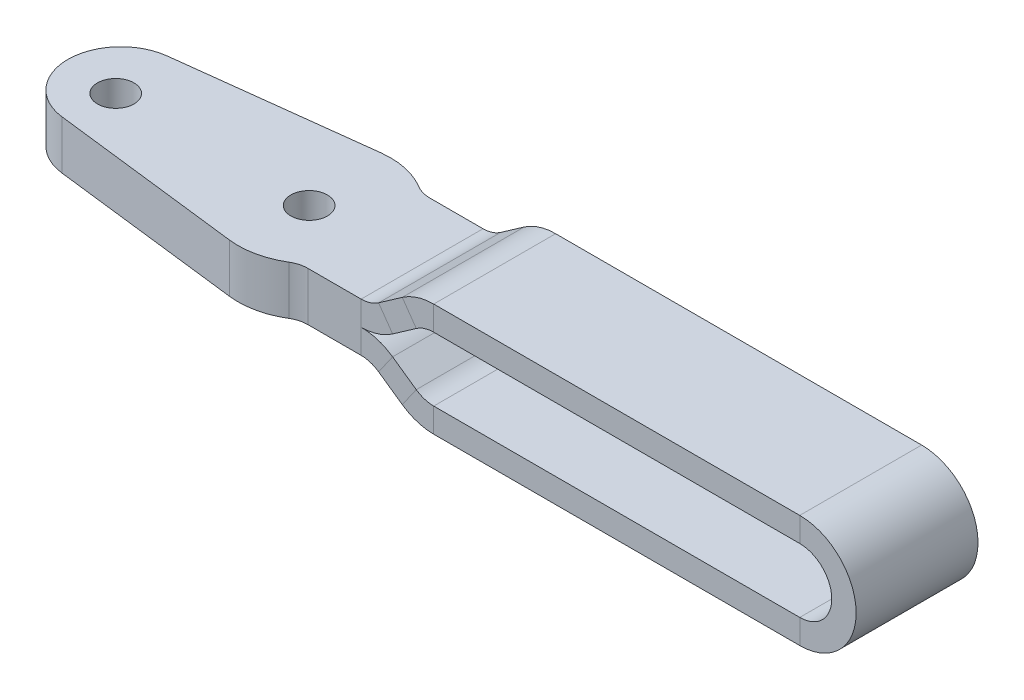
ISO-10303-21;
HEADER;
FILE_DESCRIPTION(('STEP AP214'),'2;1');
FILE_NAME('part.step','',(''),(''),'','','');
FILE_SCHEMA(('AUTOMOTIVE_DESIGN { 1 0 10303 214 1 1 1 1 }'));
ENDSEC;
DATA;
#1=APPLICATION_CONTEXT('core data for automotive mechanical design processes');
#2=APPLICATION_PROTOCOL_DEFINITION('international standard','automotive_design',2000,#1);
#3=PRODUCT_CONTEXT('',#1,'mechanical');
#4=PRODUCT('Part','Part','',(#3));
#5=PRODUCT_RELATED_PRODUCT_CATEGORY('part','',(#4));
#6=PRODUCT_DEFINITION_FORMATION('','',#4);
#7=PRODUCT_DEFINITION_CONTEXT('part definition',#1,'design');
#8=PRODUCT_DEFINITION('design','',#6,#7);
#9=PRODUCT_DEFINITION_SHAPE('','',#8);
#10=(LENGTH_UNIT() NAMED_UNIT(*) SI_UNIT(.MILLI.,.METRE.));
#11=(NAMED_UNIT(*) PLANE_ANGLE_UNIT() SI_UNIT($,.RADIAN.));
#12=(NAMED_UNIT(*) SI_UNIT($,.STERADIAN.) SOLID_ANGLE_UNIT());
#13=UNCERTAINTY_MEASURE_WITH_UNIT(LENGTH_MEASURE(1.E-05),#10,'distance_accuracy_value','');
#14=(GEOMETRIC_REPRESENTATION_CONTEXT(3) GLOBAL_UNCERTAINTY_ASSIGNED_CONTEXT((#13)) GLOBAL_UNIT_ASSIGNED_CONTEXT((#10,
#11,#12)) REPRESENTATION_CONTEXT('',''));
#15=CARTESIAN_POINT('',(0.,0.,0.));
#16=DIRECTION('',(0.,0.,1.));
#17=DIRECTION('',(1.,0.,0.));
#18=AXIS2_PLACEMENT_3D('',#15,#16,#17);
#19=CARTESIAN_POINT('',(121.348589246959,0.,-10.91));
#20=DIRECTION('',(0.,0.,1.));
#21=DIRECTION('',(0.,-1.,0.));
#22=AXIS2_PLACEMENT_3D('',#19,#20,#21);
#23=PLANE('',#22);
#24=CARTESIAN_POINT('',(121.348589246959,0.,-10.91));
#25=DIRECTION('',(0.,0.,1.));
#26=DIRECTION('',(0.,-1.,0.));
#27=AXIS2_PLACEMENT_3D('',#24,#25,#26);
#28=CIRCLE('',#27,9.25);
#29=CARTESIAN_POINT('',(121.348589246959,9.25,-10.91));
#30=VERTEX_POINT('',#29);
#31=CARTESIAN_POINT('',(121.348589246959,-9.25,-10.91));
#32=VERTEX_POINT('',#31);
#33=EDGE_CURVE('E424',#30,#32,#28,.F.);
#34=ORIENTED_EDGE('',*,*,#33,.T.);
#35=DIRECTION('',(0.,-1.,0.));
#36=VECTOR('',#35,1.);
#37=CARTESIAN_POINT('',(121.348589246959,-5.25,-10.91));
#38=LINE('',#37,#36);
#39=CARTESIAN_POINT('',(121.348589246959,-5.25,-10.91));
#40=VERTEX_POINT('',#39);
#41=EDGE_CURVE('E281',#40,#32,#38,.T.);
#42=ORIENTED_EDGE('',*,*,#41,.F.);
#43=CARTESIAN_POINT('',(121.348589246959,0.,-10.91));
#44=DIRECTION('',(0.,0.,-1.));
#45=DIRECTION('',(0.,1.,0.));
#46=AXIS2_PLACEMENT_3D('',#43,#44,#45);
#47=CIRCLE('',#46,5.25);
#48=CARTESIAN_POINT('',(121.348589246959,5.25,-10.91));
#49=VERTEX_POINT('',#48);
#50=EDGE_CURVE('E411',#49,#40,#47,.T.);
#51=ORIENTED_EDGE('',*,*,#50,.F.);
#52=DIRECTION('',(0.,1.,0.));
#53=VECTOR('',#52,1.);
#54=CARTESIAN_POINT('',(121.348589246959,5.25,-10.91));
#55=LINE('',#54,#53);
#56=EDGE_CURVE('E426',#49,#30,#55,.T.);
#57=ORIENTED_EDGE('',*,*,#56,.T.);
#58=EDGE_LOOP('',(#34,#42,#51,#57));
#59=FACE_BOUND('',#58,.T.);
#60=ADVANCED_FACE('F14',(#59),#23,.F.);
#61=CARTESIAN_POINT('',(121.348589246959,0.,-31.4840262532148));
#62=DIRECTION('',(0.,0.,1.));
#63=DIRECTION('',(0.,-1.,0.));
#64=AXIS2_PLACEMENT_3D('',#61,#62,#63);
#65=CYLINDRICAL_SURFACE('',#64,9.25);
#66=CARTESIAN_POINT('',(121.348589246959,0.,9.09));
#67=DIRECTION('',(0.,0.,1.));
#68=DIRECTION('',(0.,-1.,0.));
#69=AXIS2_PLACEMENT_3D('',#66,#67,#68);
#70=CIRCLE('',#69,9.25);
#71=CARTESIAN_POINT('',(121.348589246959,-9.25,9.09));
#72=VERTEX_POINT('',#71);
#73=CARTESIAN_POINT('',(121.348589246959,9.25,9.09));
#74=VERTEX_POINT('',#73);
#75=EDGE_CURVE('E419',#72,#74,#70,.T.);
#76=ORIENTED_EDGE('',*,*,#75,.F.);
#77=DIRECTION('',(0.,0.,1.));
#78=VECTOR('',#77,1.);
#79=CARTESIAN_POINT('',(121.348589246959,-9.25,-0.910000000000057));
#80=LINE('',#79,#78);
#81=EDGE_CURVE('E278',#32,#72,#80,.T.);
#82=ORIENTED_EDGE('',*,*,#81,.F.);
#83=ORIENTED_EDGE('',*,*,#33,.F.);
#84=DIRECTION('',(0.,0.,1.));
#85=VECTOR('',#84,1.);
#86=CARTESIAN_POINT('',(121.348589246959,9.25,-0.91000000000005));
#87=LINE('',#86,#85);
#88=EDGE_CURVE('E421',#30,#74,#87,.T.);
#89=ORIENTED_EDGE('',*,*,#88,.T.);
#90=EDGE_LOOP('',(#76,#82,#83,#89));
#91=FACE_BOUND('',#90,.T.);
#92=ADVANCED_FACE('F580',(#91),#65,.T.);
#93=CARTESIAN_POINT('',(121.348589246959,0.,9.09));
#94=DIRECTION('',(0.,0.,-1.));
#95=DIRECTION('',(0.,1.,0.));
#96=AXIS2_PLACEMENT_3D('',#93,#94,#95);
#97=PLANE('',#96);
#98=CARTESIAN_POINT('',(121.348589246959,0.,9.09));
#99=DIRECTION('',(0.,0.,1.));
#100=DIRECTION('',(0.,-1.,0.));
#101=AXIS2_PLACEMENT_3D('',#98,#99,#100);
#102=CIRCLE('',#101,5.25);
#103=CARTESIAN_POINT('',(121.348589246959,-5.25,9.09));
#104=VERTEX_POINT('',#103);
#105=CARTESIAN_POINT('',(121.348589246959,5.25,9.09));
#106=VERTEX_POINT('',#105);
#107=EDGE_CURVE('E414',#104,#106,#102,.T.);
#108=ORIENTED_EDGE('',*,*,#107,.F.);
#109=DIRECTION('',(0.,1.,0.));
#110=VECTOR('',#109,1.);
#111=CARTESIAN_POINT('',(121.348589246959,-5.25,9.09));
#112=LINE('',#111,#110);
#113=EDGE_CURVE('E274',#72,#104,#112,.T.);
#114=ORIENTED_EDGE('',*,*,#113,.F.);
#115=ORIENTED_EDGE('',*,*,#75,.T.);
#116=DIRECTION('',(0.,-1.,0.));
#117=VECTOR('',#116,1.);
#118=CARTESIAN_POINT('',(121.348589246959,5.25,9.09));
#119=LINE('',#118,#117);
#120=EDGE_CURVE('E416',#74,#106,#119,.T.);
#121=ORIENTED_EDGE('',*,*,#120,.T.);
#122=EDGE_LOOP('',(#108,#114,#115,#121));
#123=FACE_BOUND('',#122,.T.);
#124=ADVANCED_FACE('F601',(#123),#97,.F.);
#125=CARTESIAN_POINT('',(121.348589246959,0.,-31.4840262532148));
#126=DIRECTION('',(0.,0.,1.));
#127=DIRECTION('',(0.,-1.,0.));
#128=AXIS2_PLACEMENT_3D('',#125,#126,#127);
#129=CYLINDRICAL_SURFACE('',#128,5.25);
#130=ORIENTED_EDGE('',*,*,#50,.T.);
#131=DIRECTION('',(0.,0.,1.));
#132=VECTOR('',#131,1.);
#133=CARTESIAN_POINT('',(121.348589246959,-5.25,-0.91000000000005));
#134=LINE('',#133,#132);
#135=EDGE_CURVE('E285',#40,#104,#134,.T.);
#136=ORIENTED_EDGE('',*,*,#135,.T.);
#137=ORIENTED_EDGE('',*,*,#107,.T.);
#138=DIRECTION('',(0.,0.,1.));
#139=VECTOR('',#138,1.);
#140=CARTESIAN_POINT('',(121.348589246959,5.25,-0.91000000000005));
#141=LINE('',#140,#139);
#142=EDGE_CURVE('E430',#49,#106,#141,.T.);
#143=ORIENTED_EDGE('',*,*,#142,.F.);
#144=EDGE_LOOP('',(#130,#136,#137,#143));
#145=FACE_BOUND('',#144,.T.);
#146=ADVANCED_FACE('F594',(#145),#129,.F.);
#147=CARTESIAN_POINT('',(-1.44720887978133,5.24999999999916,-0.91));
#148=DIRECTION('',(0.,-1.,0.));
#149=DIRECTION('',(1.,0.,0.));
#150=AXIS2_PLACEMENT_3D('',#147,#148,#149);
#151=PLANE('',#150);
#152=DIRECTION('',(-1.,0.,0.));
#153=VECTOR('',#152,1.);
#154=CARTESIAN_POINT('',(39.2330253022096,5.24999999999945,9.09));
#155=LINE('',#154,#153);
#156=CARTESIAN_POINT('',(61.280819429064,5.2499999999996,9.09));
#157=VERTEX_POINT('',#156);
#158=EDGE_CURVE('E429',#106,#157,#155,.T.);
#159=ORIENTED_EDGE('',*,*,#158,.T.);
#160=DIRECTION('',(0.,0.,-1.));
#161=VECTOR('',#160,1.);
#162=CARTESIAN_POINT('',(61.280819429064,5.2499999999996,-0.91));
#163=LINE('',#162,#161);
#164=CARTESIAN_POINT('',(61.280819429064,5.2499999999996,-10.91));
#165=VERTEX_POINT('',#164);
#166=EDGE_CURVE('E413',#157,#165,#163,.T.);
#167=ORIENTED_EDGE('',*,*,#166,.T.);
#168=DIRECTION('',(1.,0.,0.));
#169=VECTOR('',#168,1.);
#170=CARTESIAN_POINT('',(226.240699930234,5.25000000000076,-10.91));
#171=LINE('',#170,#169);
#172=EDGE_CURVE('E433',#165,#49,#171,.T.);
#173=ORIENTED_EDGE('',*,*,#172,.T.);
#174=ORIENTED_EDGE('',*,*,#142,.T.);
#175=EDGE_LOOP('',(#159,#167,#173,#174));
#176=FACE_BOUND('',#175,.T.);
#177=ADVANCED_FACE('F597',(#176),#151,.T.);
#178=CARTESIAN_POINT('',(226.240699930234,5.25000000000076,-10.91));
#179=DIRECTION('',(0.,0.,1.));
#180=DIRECTION('',(-1.,0.,0.));
#181=AXIS2_PLACEMENT_3D('',#178,#179,#180);
#182=PLANE('',#181);
#183=DIRECTION('',(0.,-1.,0.));
#184=VECTOR('',#183,1.);
#185=CARTESIAN_POINT('',(61.280819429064,5.2499999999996,-10.91));
#186=LINE('',#185,#184);
#187=CARTESIAN_POINT('',(61.280819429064,9.2499999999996,-10.91));
#188=VERTEX_POINT('',#187);
#189=EDGE_CURVE('E442',#188,#165,#186,.T.);
#190=ORIENTED_EDGE('',*,*,#189,.F.);
#191=DIRECTION('',(1.,0.,0.));
#192=VECTOR('',#191,1.);
#193=CARTESIAN_POINT('',(226.240699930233,9.25000000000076,-10.91));
#194=LINE('',#193,#192);
#195=EDGE_CURVE('E406',#188,#30,#194,.T.);
#196=ORIENTED_EDGE('',*,*,#195,.T.);
#197=ORIENTED_EDGE('',*,*,#56,.F.);
#198=ORIENTED_EDGE('',*,*,#172,.F.);
#199=EDGE_LOOP('',(#190,#196,#197,#198));
#200=FACE_BOUND('',#199,.T.);
#201=ADVANCED_FACE('F591',(#200),#182,.F.);
#202=CARTESIAN_POINT('',(-1.44720887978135,9.24999999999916,-0.91));
#203=DIRECTION('',(0.,-1.,0.));
#204=DIRECTION('',(1.,0.,0.));
#205=AXIS2_PLACEMENT_3D('',#202,#203,#204);
#206=PLANE('',#205);
#207=DIRECTION('',(0.,0.,-1.));
#208=VECTOR('',#207,1.);
#209=CARTESIAN_POINT('',(61.280819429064,9.2499999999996,-0.91));
#210=LINE('',#209,#208);
#211=CARTESIAN_POINT('',(61.280819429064,9.2499999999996,9.09));
#212=VERTEX_POINT('',#211);
#213=EDGE_CURVE('E439',#212,#188,#210,.T.);
#214=ORIENTED_EDGE('',*,*,#213,.F.);
#215=DIRECTION('',(-1.,0.,0.));
#216=VECTOR('',#215,1.);
#217=CARTESIAN_POINT('',(39.2330253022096,9.24999999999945,9.09));
#218=LINE('',#217,#216);
#219=EDGE_CURVE('E447',#74,#212,#218,.T.);
#220=ORIENTED_EDGE('',*,*,#219,.F.);
#221=ORIENTED_EDGE('',*,*,#88,.F.);
#222=ORIENTED_EDGE('',*,*,#195,.F.);
#223=EDGE_LOOP('',(#214,#220,#221,#222));
#224=FACE_BOUND('',#223,.T.);
#225=ADVANCED_FACE('F607',(#224),#206,.F.);
#226=CARTESIAN_POINT('',(39.2330253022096,5.24999999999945,9.09));
#227=DIRECTION('',(0.,0.,-1.));
#228=DIRECTION('',(1.,0.,0.));
#229=AXIS2_PLACEMENT_3D('',#226,#227,#228);
#230=PLANE('',#229);
#231=DIRECTION('',(0.,1.,0.));
#232=VECTOR('',#231,1.);
#233=CARTESIAN_POINT('',(61.280819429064,5.2499999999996,9.09));
#234=LINE('',#233,#232);
#235=EDGE_CURVE('E436',#157,#212,#234,.T.);
#236=ORIENTED_EDGE('',*,*,#235,.F.);
#237=ORIENTED_EDGE('',*,*,#158,.F.);
#238=ORIENTED_EDGE('',*,*,#120,.F.);
#239=ORIENTED_EDGE('',*,*,#219,.T.);
#240=EDGE_LOOP('',(#236,#237,#238,#239));
#241=FACE_BOUND('',#240,.T.);
#242=ADVANCED_FACE('F604',(#241),#230,.F.);
#243=CARTESIAN_POINT('',(61.2808194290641,0.249999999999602,9.09));
#244=DIRECTION('',(0.,0.,-1.));
#245=DIRECTION('',(0.,1.,0.));
#246=AXIS2_PLACEMENT_3D('',#243,#244,#245);
#247=PLANE('',#246);
#248=ORIENTED_EDGE('',*,*,#235,.T.);
#249=CARTESIAN_POINT('',(61.2808194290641,0.249999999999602,9.09));
#250=DIRECTION('',(0.,0.,-1.));
#251=DIRECTION('',(0.,1.,0.));
#252=AXIS2_PLACEMENT_3D('',#249,#250,#251);
#253=CIRCLE('',#252,9.);
#254=CARTESIAN_POINT('',(56.1186315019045,7.62236839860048,9.09));
#255=VERTEX_POINT('',#254);
#256=EDGE_CURVE('E391',#212,#255,#253,.F.);
#257=ORIENTED_EDGE('',*,*,#256,.T.);
#258=DIRECTION('',(-0.573576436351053,0.819152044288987,0.));
#259=VECTOR('',#258,1.);
#260=CARTESIAN_POINT('',(58.4129372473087,4.34576022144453,9.09));
#261=LINE('',#260,#259);
#262=CARTESIAN_POINT('',(58.4129372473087,4.34576022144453,9.09));
#263=VERTEX_POINT('',#262);
#264=EDGE_CURVE('E394',#263,#255,#261,.T.);
#265=ORIENTED_EDGE('',*,*,#264,.F.);
#266=CARTESIAN_POINT('',(61.2808194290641,0.249999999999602,9.09));
#267=DIRECTION('',(0.,0.,1.));
#268=DIRECTION('',(0.,-1.,0.));
#269=AXIS2_PLACEMENT_3D('',#266,#267,#268);
#270=CIRCLE('',#269,5.);
#271=EDGE_CURVE('E399',#157,#263,#270,.T.);
#272=ORIENTED_EDGE('',*,*,#271,.F.);
#273=EDGE_LOOP('',(#248,#257,#265,#272));
#274=FACE_BOUND('',#273,.T.);
#275=ADVANCED_FACE('F613',(#274),#247,.F.);
#276=CARTESIAN_POINT('',(61.2808194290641,0.249999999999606,-10.91));
#277=DIRECTION('',(0.,0.,1.));
#278=DIRECTION('',(0.,-1.,0.));
#279=AXIS2_PLACEMENT_3D('',#276,#277,#278);
#280=PLANE('',#279);
#281=CARTESIAN_POINT('',(61.2808194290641,0.249999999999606,-10.91));
#282=DIRECTION('',(0.,0.,-1.));
#283=DIRECTION('',(0.,1.,0.));
#284=AXIS2_PLACEMENT_3D('',#281,#282,#283);
#285=CIRCLE('',#284,9.);
#286=CARTESIAN_POINT('',(56.1186315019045,7.62236839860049,-10.91));
#287=VERTEX_POINT('',#286);
#288=EDGE_CURVE('E403',#287,#188,#285,.T.);
#289=ORIENTED_EDGE('',*,*,#288,.T.);
#290=ORIENTED_EDGE('',*,*,#189,.T.);
#291=CARTESIAN_POINT('',(61.2808194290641,0.249999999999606,-10.91));
#292=DIRECTION('',(0.,0.,-1.));
#293=DIRECTION('',(0.,1.,0.));
#294=AXIS2_PLACEMENT_3D('',#291,#292,#293);
#295=CIRCLE('',#294,5.);
#296=CARTESIAN_POINT('',(58.4129372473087,4.34576022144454,-10.91));
#297=VERTEX_POINT('',#296);
#298=EDGE_CURVE('E402',#297,#165,#295,.T.);
#299=ORIENTED_EDGE('',*,*,#298,.F.);
#300=DIRECTION('',(0.573576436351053,-0.819152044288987,0.));
#301=VECTOR('',#300,1.);
#302=CARTESIAN_POINT('',(58.4129372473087,4.34576022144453,-10.91));
#303=LINE('',#302,#301);
#304=EDGE_CURVE('E389',#287,#297,#303,.T.);
#305=ORIENTED_EDGE('',*,*,#304,.F.);
#306=EDGE_LOOP('',(#289,#290,#299,#305));
#307=FACE_BOUND('',#306,.T.);
#308=ADVANCED_FACE('F621',(#307),#280,.F.);
#309=CARTESIAN_POINT('',(61.2808194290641,0.249999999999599,19.9294976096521));
#310=DIRECTION('',(0.,0.,-1.));
#311=DIRECTION('',(0.,1.,0.));
#312=AXIS2_PLACEMENT_3D('',#309,#310,#311);
#313=CYLINDRICAL_SURFACE('',#312,5.);
#314=DIRECTION('',(0.,0.,-1.));
#315=VECTOR('',#314,1.);
#316=CARTESIAN_POINT('',(58.4129372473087,4.34576022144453,-0.91));
#317=LINE('',#316,#315);
#318=EDGE_CURVE('E384',#263,#297,#317,.T.);
#319=ORIENTED_EDGE('',*,*,#318,.T.);
#320=ORIENTED_EDGE('',*,*,#298,.T.);
#321=ORIENTED_EDGE('',*,*,#166,.F.);
#322=ORIENTED_EDGE('',*,*,#271,.T.);
#323=EDGE_LOOP('',(#319,#320,#321,#322));
#324=FACE_BOUND('',#323,.T.);
#325=ADVANCED_FACE('F737',(#324),#313,.F.);
#326=CARTESIAN_POINT('',(61.2808194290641,0.249999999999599,19.9294976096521));
#327=DIRECTION('',(0.,0.,-1.));
#328=DIRECTION('',(0.,1.,0.));
#329=AXIS2_PLACEMENT_3D('',#326,#327,#328);
#330=CYLINDRICAL_SURFACE('',#329,9.);
#331=DIRECTION('',(0.,0.,-1.));
#332=VECTOR('',#331,1.);
#333=CARTESIAN_POINT('',(56.1186315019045,7.62236839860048,-0.91));
#334=LINE('',#333,#332);
#335=EDGE_CURVE('E392',#255,#287,#334,.T.);
#336=ORIENTED_EDGE('',*,*,#335,.F.);
#337=ORIENTED_EDGE('',*,*,#256,.F.);
#338=ORIENTED_EDGE('',*,*,#213,.T.);
#339=ORIENTED_EDGE('',*,*,#288,.F.);
#340=EDGE_LOOP('',(#336,#337,#338,#339));
#341=FACE_BOUND('',#340,.T.);
#342=ADVANCED_FACE('F616',(#341),#330,.T.);
#343=CARTESIAN_POINT('',(10.5318851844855,-29.1809133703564,-0.91));
#344=DIRECTION('',(0.573576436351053,-0.819152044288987,0.));
#345=DIRECTION('',(0.819152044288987,0.573576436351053,0.));
#346=AXIS2_PLACEMENT_3D('',#343,#344,#345);
#347=PLANE('',#346);
#348=DIRECTION('',(-0.819152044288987,-0.573576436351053,0.));
#349=VECTOR('',#348,1.);
#350=CARTESIAN_POINT('',(43.8551821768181,-5.84768961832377,9.09));
#351=LINE('',#350,#349);
#352=CARTESIAN_POINT('',(54.5310472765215,1.62763160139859,9.09));
#353=VERTEX_POINT('',#352);
#354=EDGE_CURVE('E18',#263,#353,#351,.T.);
#355=ORIENTED_EDGE('',*,*,#354,.T.);
#356=DIRECTION('',(0.,0.,-1.));
#357=VECTOR('',#356,1.);
#358=CARTESIAN_POINT('',(54.5310472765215,1.62763160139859,-0.91));
#359=LINE('',#358,#357);
#360=CARTESIAN_POINT('',(54.5310472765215,1.62763160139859,-10.91));
#361=VERTEX_POINT('',#360);
#362=EDGE_CURVE('E445',#353,#361,#359,.T.);
#363=ORIENTED_EDGE('',*,*,#362,.T.);
#364=DIRECTION('',(0.819152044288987,0.573576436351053,0.));
#365=VECTOR('',#364,1.);
#366=CARTESIAN_POINT('',(197.042901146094,101.415505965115,-10.91));
#367=LINE('',#366,#365);
#368=EDGE_CURVE('E396',#361,#297,#367,.T.);
#369=ORIENTED_EDGE('',*,*,#368,.T.);
#370=ORIENTED_EDGE('',*,*,#318,.F.);
#371=EDGE_LOOP('',(#355,#363,#369,#370));
#372=FACE_BOUND('',#371,.T.);
#373=ADVANCED_FACE('F462',(#372),#347,.T.);
#374=CARTESIAN_POINT('',(43.8551821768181,-5.84768961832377,9.09));
#375=DIRECTION('',(0.,0.,-1.));
#376=DIRECTION('',(0.819152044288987,0.573576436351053,0.));
#377=AXIS2_PLACEMENT_3D('',#374,#375,#376);
#378=PLANE('',#377);
#379=DIRECTION('',(-0.573576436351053,0.819152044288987,0.));
#380=VECTOR('',#379,1.);
#381=CARTESIAN_POINT('',(54.5310472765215,1.62763160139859,9.09));
#382=LINE('',#381,#380);
#383=CARTESIAN_POINT('',(52.2367415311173,4.90423977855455,9.09));
#384=VERTEX_POINT('',#383);
#385=EDGE_CURVE('E453',#353,#384,#382,.T.);
#386=ORIENTED_EDGE('',*,*,#385,.F.);
#387=ORIENTED_EDGE('',*,*,#354,.F.);
#388=ORIENTED_EDGE('',*,*,#264,.T.);
#389=DIRECTION('',(-0.819152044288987,-0.573576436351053,0.));
#390=VECTOR('',#389,1.);
#391=CARTESIAN_POINT('',(41.560876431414,-2.57108144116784,9.09));
#392=LINE('',#391,#390);
#393=EDGE_CURVE('E39',#255,#384,#392,.T.);
#394=ORIENTED_EDGE('',*,*,#393,.T.);
#395=EDGE_LOOP('',(#386,#387,#388,#394));
#396=FACE_BOUND('',#395,.T.);
#397=ADVANCED_FACE('F465',(#396),#378,.F.);
#398=CARTESIAN_POINT('',(8.2375794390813,-25.9043051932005,-0.91));
#399=DIRECTION('',(0.573576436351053,-0.819152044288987,0.));
#400=DIRECTION('',(0.819152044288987,0.573576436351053,0.));
#401=AXIS2_PLACEMENT_3D('',#398,#399,#400);
#402=PLANE('',#401);
#403=DIRECTION('',(0.,0.,-1.));
#404=VECTOR('',#403,1.);
#405=CARTESIAN_POINT('',(52.2367415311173,4.90423977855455,-0.91));
#406=LINE('',#405,#404);
#407=CARTESIAN_POINT('',(52.2367415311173,4.90423977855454,-10.91));
#408=VERTEX_POINT('',#407);
#409=EDGE_CURVE('E23',#384,#408,#406,.T.);
#410=ORIENTED_EDGE('',*,*,#409,.F.);
#411=ORIENTED_EDGE('',*,*,#393,.F.);
#412=ORIENTED_EDGE('',*,*,#335,.T.);
#413=DIRECTION('',(0.819152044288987,0.573576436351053,0.));
#414=VECTOR('',#413,1.);
#415=CARTESIAN_POINT('',(194.74859540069,104.692114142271,-10.91));
#416=LINE('',#415,#414);
#417=EDGE_CURVE('E31',#408,#287,#416,.T.);
#418=ORIENTED_EDGE('',*,*,#417,.F.);
#419=EDGE_LOOP('',(#410,#411,#412,#418));
#420=FACE_BOUND('',#419,.T.);
#421=ADVANCED_FACE('F618',(#420),#402,.F.);
#422=CARTESIAN_POINT('',(197.042901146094,101.415505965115,-10.91));
#423=DIRECTION('',(0.,0.,1.));
#424=DIRECTION('',(-0.819152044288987,-0.573576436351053,0.));
#425=AXIS2_PLACEMENT_3D('',#422,#423,#424);
#426=PLANE('',#425);
#427=DIRECTION('',(0.573576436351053,-0.819152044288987,0.));
#428=VECTOR('',#427,1.);
#429=CARTESIAN_POINT('',(54.5310472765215,1.62763160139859,-10.91));
#430=LINE('',#429,#428);
#431=EDGE_CURVE('E9',#408,#361,#430,.T.);
#432=ORIENTED_EDGE('',*,*,#431,.F.);
#433=ORIENTED_EDGE('',*,*,#417,.T.);
#434=ORIENTED_EDGE('',*,*,#304,.T.);
#435=ORIENTED_EDGE('',*,*,#368,.F.);
#436=EDGE_LOOP('',(#432,#433,#434,#435));
#437=FACE_BOUND('',#436,.T.);
#438=ADVANCED_FACE('F16',(#437),#426,.F.);
#439=CARTESIAN_POINT('',(49.3688593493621,8.99999999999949,9.09));
#440=DIRECTION('',(0.,0.,1.));
#441=DIRECTION('',(0.,-1.,0.));
#442=AXIS2_PLACEMENT_3D('',#439,#440,#441);
#443=PLANE('',#442);
#444=ORIENTED_EDGE('',*,*,#385,.T.);
#445=CARTESIAN_POINT('',(49.3688593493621,8.99999999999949,9.09));
#446=DIRECTION('',(0.,0.,-1.));
#447=DIRECTION('',(0.,1.,0.));
#448=AXIS2_PLACEMENT_3D('',#445,#446,#447);
#449=CIRCLE('',#448,5.);
#450=CARTESIAN_POINT('',(49.3688593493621,3.99999999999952,9.09));
#451=VERTEX_POINT('',#450);
#452=EDGE_CURVE('E337',#384,#451,#449,.T.);
#453=ORIENTED_EDGE('',*,*,#452,.T.);
#454=DIRECTION('',(0.,1.,0.));
#455=VECTOR('',#454,1.);
#456=CARTESIAN_POINT('',(49.3688593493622,-4.78783679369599E-13,9.09));
#457=LINE('',#456,#455);
#458=CARTESIAN_POINT('',(49.3688593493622,-4.78783679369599E-13,9.09));
#459=VERTEX_POINT('',#458);
#460=EDGE_CURVE('E348',#459,#451,#457,.T.);
#461=ORIENTED_EDGE('',*,*,#460,.F.);
#462=CARTESIAN_POINT('',(49.3688593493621,8.99999999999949,9.09));
#463=DIRECTION('',(0.,0.,-1.));
#464=DIRECTION('',(0.,1.,0.));
#465=AXIS2_PLACEMENT_3D('',#462,#463,#464);
#466=CIRCLE('',#465,9.);
#467=EDGE_CURVE('E377',#353,#459,#466,.T.);
#468=ORIENTED_EDGE('',*,*,#467,.F.);
#469=EDGE_LOOP('',(#444,#453,#461,#468));
#470=FACE_BOUND('',#469,.T.);
#471=ADVANCED_FACE('F472',(#470),#443,.T.);
#472=CARTESIAN_POINT('',(49.3688593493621,8.99999999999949,-10.91));
#473=DIRECTION('',(0.,0.,-1.));
#474=DIRECTION('',(0.,1.,0.));
#475=AXIS2_PLACEMENT_3D('',#472,#473,#474);
#476=PLANE('',#475);
#477=CARTESIAN_POINT('',(49.3688593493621,8.99999999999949,-10.91));
#478=DIRECTION('',(0.,0.,-1.));
#479=DIRECTION('',(0.,1.,0.));
#480=AXIS2_PLACEMENT_3D('',#477,#478,#479);
#481=CIRCLE('',#480,5.);
#482=CARTESIAN_POINT('',(49.3688593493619,3.99999999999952,-10.91));
#483=VERTEX_POINT('',#482);
#484=EDGE_CURVE('E381',#483,#408,#481,.F.);
#485=ORIENTED_EDGE('',*,*,#484,.T.);
#486=ORIENTED_EDGE('',*,*,#431,.T.);
#487=CARTESIAN_POINT('',(49.3688593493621,8.99999999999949,-10.91));
#488=DIRECTION('',(0.,0.,1.));
#489=DIRECTION('',(0.,-1.,0.));
#490=AXIS2_PLACEMENT_3D('',#487,#488,#489);
#491=CIRCLE('',#490,9.);
#492=CARTESIAN_POINT('',(49.3688593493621,4.8919202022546E-13,-10.91));
#493=VERTEX_POINT('',#492);
#494=EDGE_CURVE('E380',#493,#361,#491,.T.);
#495=ORIENTED_EDGE('',*,*,#494,.F.);
#496=DIRECTION('',(0.,-1.,0.));
#497=VECTOR('',#496,1.);
#498=CARTESIAN_POINT('',(49.3688593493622,-4.83987849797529E-13,-10.91));
#499=LINE('',#498,#497);
#500=EDGE_CURVE('E338',#483,#493,#499,.T.);
#501=ORIENTED_EDGE('',*,*,#500,.F.);
#502=EDGE_LOOP('',(#485,#486,#495,#501));
#503=FACE_BOUND('',#502,.T.);
#504=ADVANCED_FACE('F489',(#503),#476,.T.);
#505=CARTESIAN_POINT('',(49.3688593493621,8.99999999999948,20.6869926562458));
#506=DIRECTION('',(0.,0.,-1.));
#507=DIRECTION('',(0.,1.,0.));
#508=AXIS2_PLACEMENT_3D('',#505,#506,#507);
#509=CYLINDRICAL_SURFACE('',#508,9.);
#510=DIRECTION('',(0.,0.,-1.));
#511=VECTOR('',#510,1.);
#512=CARTESIAN_POINT('',(49.3688593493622,4.7791631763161E-13,-0.91));
#513=LINE('',#512,#511);
#514=EDGE_CURVE('E232',#459,#493,#513,.T.);
#515=ORIENTED_EDGE('',*,*,#514,.T.);
#516=ORIENTED_EDGE('',*,*,#494,.T.);
#517=ORIENTED_EDGE('',*,*,#362,.F.);
#518=ORIENTED_EDGE('',*,*,#467,.T.);
#519=EDGE_LOOP('',(#515,#516,#517,#518));
#520=FACE_BOUND('',#519,.T.);
#521=ADVANCED_FACE('F470',(#520),#509,.T.);
#522=CARTESIAN_POINT('',(49.3688593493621,8.99999999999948,20.6869926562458));
#523=DIRECTION('',(0.,0.,-1.));
#524=DIRECTION('',(0.,1.,0.));
#525=AXIS2_PLACEMENT_3D('',#522,#523,#524);
#526=CYLINDRICAL_SURFACE('',#525,5.);
#527=DIRECTION('',(0.,0.,-1.));
#528=VECTOR('',#527,1.);
#529=CARTESIAN_POINT('',(49.3688593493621,3.99999999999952,-0.91));
#530=LINE('',#529,#528);
#531=EDGE_CURVE('E343',#451,#483,#530,.T.);
#532=ORIENTED_EDGE('',*,*,#531,.F.);
#533=ORIENTED_EDGE('',*,*,#452,.F.);
#534=ORIENTED_EDGE('',*,*,#409,.T.);
#535=ORIENTED_EDGE('',*,*,#484,.F.);
#536=EDGE_LOOP('',(#532,#533,#534,#535));
#537=FACE_BOUND('',#536,.T.);
#538=ADVANCED_FACE('F480',(#537),#526,.F.);
#539=CARTESIAN_POINT('',(40.612091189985,-5.42101086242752E-13,-15.6099802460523));
#540=DIRECTION('',(0.,1.,0.));
#541=DIRECTION('',(-1.,0.,0.));
#542=AXIS2_PLACEMENT_3D('',#539,#540,#541);
#543=CYLINDRICAL_SURFACE('',#542,4.69998024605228);
#544=CARTESIAN_POINT('',(40.612091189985,3.99999999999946,-15.6099802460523));
#545=DIRECTION('',(0.,1.,0.));
#546=DIRECTION('',(1.,0.,0.));
#547=AXIS2_PLACEMENT_3D('',#544,#545,#546);
#548=CIRCLE('',#547,4.69998024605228);
#549=CARTESIAN_POINT('',(38.1718420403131,3.99999999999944,-11.5931408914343));
#550=VERTEX_POINT('',#549);
#551=CARTESIAN_POINT('',(40.612091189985,3.99999999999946,-10.91));
#552=VERTEX_POINT('',#551);
#553=EDGE_CURVE('E333',#550,#552,#548,.T.);
#554=ORIENTED_EDGE('',*,*,#553,.T.);
#555=DIRECTION('',(0.,1.,0.));
#556=VECTOR('',#555,1.);
#557=CARTESIAN_POINT('',(40.612091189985,-5.43835809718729E-13,-10.91));
#558=LINE('',#557,#556);
#559=CARTESIAN_POINT('',(40.612091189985,-3.99999999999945,-10.91));
#560=VERTEX_POINT('',#559);
#561=EDGE_CURVE('E334',#560,#552,#558,.T.);
#562=ORIENTED_EDGE('',*,*,#561,.F.);
#563=CARTESIAN_POINT('',(40.612091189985,-3.99999999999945,-15.6099802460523));
#564=DIRECTION('',(0.,1.,0.));
#565=DIRECTION('',(1.,0.,0.));
#566=AXIS2_PLACEMENT_3D('',#563,#564,#565);
#567=CIRCLE('',#566,4.69998024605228);
#568=CARTESIAN_POINT('',(38.1718420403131,-3.99999999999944,-11.5931408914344));
#569=VERTEX_POINT('',#568);
#570=EDGE_CURVE('E226',#569,#560,#567,.T.);
#571=ORIENTED_EDGE('',*,*,#570,.F.);
#572=DIRECTION('',(0.,1.,0.));
#573=VECTOR('',#572,1.);
#574=CARTESIAN_POINT('',(38.1718420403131,-5.53376788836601E-13,-11.5931408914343));
#575=LINE('',#574,#573);
#576=EDGE_CURVE('E373',#569,#550,#575,.T.);
#577=ORIENTED_EDGE('',*,*,#576,.T.);
#578=EDGE_LOOP('',(#554,#562,#571,#577));
#579=FACE_BOUND('',#578,.T.);
#580=ADVANCED_FACE('F533',(#579),#543,.F.);
#581=CARTESIAN_POINT('',(31.6818198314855,-6.06285854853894E-13,-0.91));
#582=DIRECTION('',(0.,1.,0.));
#583=DIRECTION('',(-1.,0.,0.));
#584=AXIS2_PLACEMENT_3D('',#581,#582,#583);
#585=CYLINDRICAL_SURFACE('',#584,12.4999955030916);
#586=CARTESIAN_POINT('',(31.6818198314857,3.9999999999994,-0.91));
#587=DIRECTION('',(0.,-1.,0.));
#588=DIRECTION('',(1.,0.,0.));
#589=AXIS2_PLACEMENT_3D('',#586,#587,#588);
#590=CIRCLE('',#589,12.4999955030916);
#591=CARTESIAN_POINT('',(30.1857574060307,3.99999999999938,-13.3201444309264));
#592=VERTEX_POINT('',#591);
#593=EDGE_CURVE('E371',#592,#550,#590,.T.);
#594=ORIENTED_EDGE('',*,*,#593,.T.);
#595=ORIENTED_EDGE('',*,*,#576,.F.);
#596=CARTESIAN_POINT('',(31.6818198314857,-3.9999999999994,-0.91));
#597=DIRECTION('',(0.,-1.,0.));
#598=DIRECTION('',(1.,0.,0.));
#599=AXIS2_PLACEMENT_3D('',#596,#597,#598);
#600=CIRCLE('',#599,12.4999955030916);
#601=CARTESIAN_POINT('',(30.1857574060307,-3.99999999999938,-13.3201444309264));
#602=VERTEX_POINT('',#601);
#603=EDGE_CURVE('E224',#602,#569,#600,.T.);
#604=ORIENTED_EDGE('',*,*,#603,.F.);
#605=DIRECTION('',(0.,1.,0.));
#606=VECTOR('',#605,1.);
#607=CARTESIAN_POINT('',(30.1857574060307,-6.13224748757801E-13,-13.3201444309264));
#608=LINE('',#607,#606);
#609=EDGE_CURVE('E223',#602,#592,#608,.T.);
#610=ORIENTED_EDGE('',*,*,#609,.T.);
#611=EDGE_LOOP('',(#594,#595,#604,#610));
#612=FACE_BOUND('',#611,.T.);
#613=ADVANCED_FACE('F530',(#612),#585,.T.);
#614=CARTESIAN_POINT('',(-1.10940281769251,-7.84095011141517E-13,-9.54746365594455));
#615=DIRECTION('',(0.119685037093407,0.,0.992811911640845));
#616=DIRECTION('',(-0.992811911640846,0.,0.119685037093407));
#617=AXIS2_PLACEMENT_3D('',#614,#615,#616);
#618=PLANE('',#617);
#619=DIRECTION('',(0.992811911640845,0.,-0.119685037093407));
#620=VECTOR('',#619,1.);
#621=CARTESIAN_POINT('',(-1.10940281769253,3.99999999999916,-9.54746365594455));
#622=LINE('',#621,#620);
#623=CARTESIAN_POINT('',(-1.10940281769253,3.99999999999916,-9.54746365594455));
#624=VERTEX_POINT('',#623);
#625=EDGE_CURVE('E206',#624,#592,#622,.T.);
#626=ORIENTED_EDGE('',*,*,#625,.T.);
#627=ORIENTED_EDGE('',*,*,#609,.F.);
#628=DIRECTION('',(0.992811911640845,0.,-0.119685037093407));
#629=VECTOR('',#628,1.);
#630=CARTESIAN_POINT('',(-1.10940281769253,-3.99999999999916,-9.54746365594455));
#631=LINE('',#630,#629);
#632=CARTESIAN_POINT('',(-1.10940281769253,-3.99999999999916,-9.54746365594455));
#633=VERTEX_POINT('',#632);
#634=EDGE_CURVE('E215',#633,#602,#631,.T.);
#635=ORIENTED_EDGE('',*,*,#634,.F.);
#636=DIRECTION('',(0.,1.,0.));
#637=VECTOR('',#636,1.);
#638=CARTESIAN_POINT('',(-1.10940281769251,-7.84095011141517E-13,-9.54746365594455));
#639=LINE('',#638,#637);
#640=EDGE_CURVE('E197',#633,#624,#639,.T.);
#641=ORIENTED_EDGE('',*,*,#640,.T.);
#642=EDGE_LOOP('',(#626,#627,#635,#641));
#643=FACE_BOUND('',#642,.T.);
#644=ADVANCED_FACE('F221',(#643),#618,.F.);
#645=CARTESIAN_POINT('',(-0.0681429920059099,-7.85829734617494E-13,-0.91));
#646=DIRECTION('',(0.,1.,0.));
#647=DIRECTION('',(-1.,0.,0.));
#648=AXIS2_PLACEMENT_3D('',#645,#646,#647);
#649=CYLINDRICAL_SURFACE('',#648,8.70000002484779);
#650=CARTESIAN_POINT('',(-0.068142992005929,3.99999999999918,-0.91));
#651=DIRECTION('',(0.,-1.,0.));
#652=DIRECTION('',(1.,0.,0.));
#653=AXIS2_PLACEMENT_3D('',#650,#651,#652);
#654=CIRCLE('',#653,8.70000002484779);
#655=CARTESIAN_POINT('',(-1.10940281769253,3.99999999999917,7.72746365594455));
#656=VERTEX_POINT('',#655);
#657=EDGE_CURVE('E203',#656,#624,#654,.T.);
#658=ORIENTED_EDGE('',*,*,#657,.T.);
#659=ORIENTED_EDGE('',*,*,#640,.F.);
#660=CARTESIAN_POINT('',(-0.068142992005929,-3.99999999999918,-0.91));
#661=DIRECTION('',(0.,-1.,0.));
#662=DIRECTION('',(1.,0.,0.));
#663=AXIS2_PLACEMENT_3D('',#660,#661,#662);
#664=CIRCLE('',#663,8.70000002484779);
#665=CARTESIAN_POINT('',(-1.10940281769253,-3.99999999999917,7.72746365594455));
#666=VERTEX_POINT('',#665);
#667=EDGE_CURVE('E201',#666,#633,#664,.T.);
#668=ORIENTED_EDGE('',*,*,#667,.F.);
#669=DIRECTION('',(0.,1.,0.));
#670=VECTOR('',#669,1.);
#671=CARTESIAN_POINT('',(-1.10940281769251,-7.88431819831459E-13,7.72746365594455));
#672=LINE('',#671,#670);
#673=EDGE_CURVE('E366',#666,#656,#672,.T.);
#674=ORIENTED_EDGE('',*,*,#673,.T.);
#675=EDGE_LOOP('',(#658,#659,#668,#674));
#676=FACE_BOUND('',#675,.T.);
#677=ADVANCED_FACE('F199',(#676),#649,.T.);
#678=CARTESIAN_POINT('',(30.1857574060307,-6.1929628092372E-13,11.5001417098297));
#679=DIRECTION('',(0.11968495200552,0.,-0.99281192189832));
#680=DIRECTION('',(0.99281192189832,0.,0.11968495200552));
#681=AXIS2_PLACEMENT_3D('',#678,#679,#680);
#682=PLANE('',#681);
#683=DIRECTION('',(-0.99281192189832,0.,-0.11968495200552));
#684=VECTOR('',#683,1.);
#685=CARTESIAN_POINT('',(30.1857574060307,3.99999999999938,11.5001417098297));
#686=LINE('',#685,#684);
#687=CARTESIAN_POINT('',(30.1857574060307,3.99999999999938,11.5001417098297));
#688=VERTEX_POINT('',#687);
#689=EDGE_CURVE('E364',#688,#656,#686,.T.);
#690=ORIENTED_EDGE('',*,*,#689,.T.);
#691=ORIENTED_EDGE('',*,*,#673,.F.);
#692=DIRECTION('',(-0.99281192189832,0.,-0.11968495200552));
#693=VECTOR('',#692,1.);
#694=CARTESIAN_POINT('',(30.1857574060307,-3.99999999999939,11.5001417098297));
#695=LINE('',#694,#693);
#696=CARTESIAN_POINT('',(30.1857574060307,-3.99999999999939,11.5001417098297));
#697=VERTEX_POINT('',#696);
#698=EDGE_CURVE('E219',#697,#666,#695,.T.);
#699=ORIENTED_EDGE('',*,*,#698,.F.);
#700=DIRECTION('',(0.,1.,0.));
#701=VECTOR('',#700,1.);
#702=CARTESIAN_POINT('',(30.1857574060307,-6.1929628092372E-13,11.5001417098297));
#703=LINE('',#702,#701);
#704=EDGE_CURVE('E361',#697,#688,#703,.T.);
#705=ORIENTED_EDGE('',*,*,#704,.T.);
#706=EDGE_LOOP('',(#690,#691,#699,#705));
#707=FACE_BOUND('',#706,.T.);
#708=ADVANCED_FACE('F525',(#707),#682,.F.);
#709=CARTESIAN_POINT('',(31.6818198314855,-6.06285854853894E-13,-0.91));
#710=DIRECTION('',(0.,1.,0.));
#711=DIRECTION('',(-1.,0.,0.));
#712=AXIS2_PLACEMENT_3D('',#709,#710,#711);
#713=CYLINDRICAL_SURFACE('',#712,12.4999928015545);
#714=CARTESIAN_POINT('',(31.6818198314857,3.9999999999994,-0.91));
#715=DIRECTION('',(0.,-1.,0.));
#716=DIRECTION('',(1.,0.,0.));
#717=AXIS2_PLACEMENT_3D('',#714,#715,#716);
#718=CIRCLE('',#717,12.4999928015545);
#719=CARTESIAN_POINT('',(38.1718420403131,3.99999999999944,9.7731377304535));
#720=VERTEX_POINT('',#719);
#721=EDGE_CURVE('E359',#720,#688,#718,.T.);
#722=ORIENTED_EDGE('',*,*,#721,.T.);
#723=ORIENTED_EDGE('',*,*,#704,.F.);
#724=CARTESIAN_POINT('',(31.6818198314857,-3.9999999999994,-0.91));
#725=DIRECTION('',(0.,-1.,0.));
#726=DIRECTION('',(1.,0.,0.));
#727=AXIS2_PLACEMENT_3D('',#724,#725,#726);
#728=CIRCLE('',#727,12.4999928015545);
#729=CARTESIAN_POINT('',(38.1718420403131,-3.99999999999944,9.7731377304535));
#730=VERTEX_POINT('',#729);
#731=EDGE_CURVE('E520',#730,#697,#728,.T.);
#732=ORIENTED_EDGE('',*,*,#731,.F.);
#733=DIRECTION('',(0.,1.,0.));
#734=VECTOR('',#733,1.);
#735=CARTESIAN_POINT('',(38.1718420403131,-5.58580959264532E-13,9.7731377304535));
#736=LINE('',#735,#734);
#737=EDGE_CURVE('E356',#730,#720,#736,.T.);
#738=ORIENTED_EDGE('',*,*,#737,.T.);
#739=EDGE_LOOP('',(#722,#723,#732,#738));
#740=FACE_BOUND('',#739,.T.);
#741=ADVANCED_FACE('F815',(#740),#713,.T.);
#742=CARTESIAN_POINT('',(40.612091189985,-5.39499001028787E-13,13.7899988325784));
#743=DIRECTION('',(0.,1.,0.));
#744=DIRECTION('',(-1.,0.,0.));
#745=AXIS2_PLACEMENT_3D('',#742,#743,#744);
#746=CYLINDRICAL_SURFACE('',#745,4.69999883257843);
#747=CARTESIAN_POINT('',(40.612091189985,3.99999999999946,13.7899988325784));
#748=DIRECTION('',(0.,1.,0.));
#749=DIRECTION('',(1.,0.,0.));
#750=AXIS2_PLACEMENT_3D('',#747,#748,#749);
#751=CIRCLE('',#750,4.69999883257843);
#752=CARTESIAN_POINT('',(40.612091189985,3.99999999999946,9.09));
#753=VERTEX_POINT('',#752);
#754=EDGE_CURVE('E354',#753,#720,#751,.T.);
#755=ORIENTED_EDGE('',*,*,#754,.T.);
#756=ORIENTED_EDGE('',*,*,#737,.F.);
#757=CARTESIAN_POINT('',(40.612091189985,-3.99999999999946,13.7899988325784));
#758=DIRECTION('',(0.,1.,0.));
#759=DIRECTION('',(1.,0.,0.));
#760=AXIS2_PLACEMENT_3D('',#757,#758,#759);
#761=CIRCLE('',#760,4.69999883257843);
#762=CARTESIAN_POINT('',(40.612091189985,-3.99999999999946,9.09));
#763=VERTEX_POINT('',#762);
#764=EDGE_CURVE('E517',#763,#730,#761,.T.);
#765=ORIENTED_EDGE('',*,*,#764,.F.);
#766=DIRECTION('',(0.,1.,0.));
#767=VECTOR('',#766,1.);
#768=CARTESIAN_POINT('',(40.612091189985,-5.38631639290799E-13,9.09));
#769=LINE('',#768,#767);
#770=EDGE_CURVE('E351',#763,#753,#769,.T.);
#771=ORIENTED_EDGE('',*,*,#770,.T.);
#772=EDGE_LOOP('',(#755,#756,#765,#771));
#773=FACE_BOUND('',#772,.T.);
#774=ADVANCED_FACE('F806',(#773),#746,.F.);
#775=CARTESIAN_POINT('',(40.612091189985,-5.38631639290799E-13,9.09));
#776=DIRECTION('',(0.,0.,-1.));
#777=DIRECTION('',(1.,0.,0.));
#778=AXIS2_PLACEMENT_3D('',#775,#776,#777);
#779=PLANE('',#778);
#780=ORIENTED_EDGE('',*,*,#770,.F.);
#781=DIRECTION('',(-1.,0.,0.));
#782=VECTOR('',#781,1.);
#783=CARTESIAN_POINT('',(40.612091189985,-3.99999999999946,9.09));
#784=LINE('',#783,#782);
#785=CARTESIAN_POINT('',(49.3688593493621,-3.99999999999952,9.09));
#786=VERTEX_POINT('',#785);
#787=EDGE_CURVE('E514',#786,#763,#784,.T.);
#788=ORIENTED_EDGE('',*,*,#787,.F.);
#789=DIRECTION('',(0.,-1.,0.));
#790=VECTOR('',#789,1.);
#791=CARTESIAN_POINT('',(49.3688593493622,4.75314232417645E-13,9.09));
#792=LINE('',#791,#790);
#793=EDGE_CURVE('E477',#459,#786,#792,.T.);
#794=ORIENTED_EDGE('',*,*,#793,.F.);
#795=ORIENTED_EDGE('',*,*,#460,.T.);
#796=DIRECTION('',(-1.,0.,0.));
#797=VECTOR('',#796,1.);
#798=CARTESIAN_POINT('',(40.612091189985,3.99999999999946,9.09));
#799=LINE('',#798,#797);
#800=EDGE_CURVE('E346',#451,#753,#799,.T.);
#801=ORIENTED_EDGE('',*,*,#800,.T.);
#802=EDGE_LOOP('',(#780,#788,#794,#795,#801));
#803=FACE_BOUND('',#802,.T.);
#804=ADVANCED_FACE('F475',(#803),#779,.F.);
#805=CARTESIAN_POINT('',(-0.068142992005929,3.99999999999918,-0.91));
#806=DIRECTION('',(0.,-1.,0.));
#807=DIRECTION('',(1.,0.,0.));
#808=AXIS2_PLACEMENT_3D('',#805,#806,#807);
#809=PLANE('',#808);
#810=ORIENTED_EDGE('',*,*,#800,.F.);
#811=ORIENTED_EDGE('',*,*,#531,.T.);
#812=DIRECTION('',(1.,0.,0.));
#813=VECTOR('',#812,1.);
#814=CARTESIAN_POINT('',(227.619765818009,4.00000000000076,-10.91));
#815=LINE('',#814,#813);
#816=EDGE_CURVE('E341',#552,#483,#815,.T.);
#817=ORIENTED_EDGE('',*,*,#816,.F.);
#818=ORIENTED_EDGE('',*,*,#553,.F.);
#819=ORIENTED_EDGE('',*,*,#593,.F.);
#820=ORIENTED_EDGE('',*,*,#625,.F.);
#821=ORIENTED_EDGE('',*,*,#657,.F.);
#822=ORIENTED_EDGE('',*,*,#689,.F.);
#823=ORIENTED_EDGE('',*,*,#721,.F.);
#824=ORIENTED_EDGE('',*,*,#754,.F.);
#825=EDGE_LOOP('',(#810,#811,#817,#818,#819,#820,#821,#822,#823,#824));
#826=FACE_BOUND('',#825,.T.);
#827=CARTESIAN_POINT('',(31.79451365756,3.99999999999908,0.0499999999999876));
#828=DIRECTION('',(0.,1.,0.));
#829=DIRECTION('',(-1.,0.,0.));
#830=AXIS2_PLACEMENT_3D('',#827,#828,#829);
#831=CIRCLE('',#830,3.);
#832=CARTESIAN_POINT('',(28.79451365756,3.99999999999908,0.0499999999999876));
#833=VERTEX_POINT('',#832);
#834=EDGE_CURVE('E330',#833,#833,#831,.T.);
#835=ORIENTED_EDGE('',*,*,#834,.F.);
#836=EDGE_LOOP('',(#835));
#837=FACE_BOUND('',#836,.T.);
#838=CARTESIAN_POINT('',(0.,3.99999999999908,0.));
#839=DIRECTION('',(0.,1.,0.));
#840=DIRECTION('',(-1.,0.,0.));
#841=AXIS2_PLACEMENT_3D('',#838,#839,#840);
#842=CIRCLE('',#841,3.);
#843=CARTESIAN_POINT('',(-3.,3.99999999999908,0.));
#844=VERTEX_POINT('',#843);
#845=EDGE_CURVE('E321',#844,#844,#842,.T.);
#846=ORIENTED_EDGE('',*,*,#845,.F.);
#847=EDGE_LOOP('',(#846));
#848=FACE_BOUND('',#847,.T.);
#849=ADVANCED_FACE('F484',(#826,#837,#848),#809,.F.);
#850=CARTESIAN_POINT('',(227.619765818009,7.6588041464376E-13,-10.91));
#851=DIRECTION('',(0.,0.,1.));
#852=DIRECTION('',(-1.,0.,0.));
#853=AXIS2_PLACEMENT_3D('',#850,#851,#852);
#854=PLANE('',#853);
#855=ORIENTED_EDGE('',*,*,#816,.T.);
#856=ORIENTED_EDGE('',*,*,#500,.T.);
#857=DIRECTION('',(0.,1.,0.));
#858=VECTOR('',#857,1.);
#859=CARTESIAN_POINT('',(49.3688593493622,4.8919202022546E-13,-10.91));
#860=LINE('',#859,#858);
#861=CARTESIAN_POINT('',(49.3688593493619,-3.99999999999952,-10.91));
#862=VERTEX_POINT('',#861);
#863=EDGE_CURVE('E246',#862,#493,#860,.T.);
#864=ORIENTED_EDGE('',*,*,#863,.F.);
#865=DIRECTION('',(1.,0.,0.));
#866=VECTOR('',#865,1.);
#867=CARTESIAN_POINT('',(227.619765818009,-4.00000000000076,-10.91));
#868=LINE('',#867,#866);
#869=EDGE_CURVE('E505',#560,#862,#868,.T.);
#870=ORIENTED_EDGE('',*,*,#869,.F.);
#871=ORIENTED_EDGE('',*,*,#561,.T.);
#872=EDGE_LOOP('',(#855,#856,#864,#870,#871));
#873=FACE_BOUND('',#872,.T.);
#874=ADVANCED_FACE('F493',(#873),#854,.F.);
#875=CARTESIAN_POINT('',(31.79451365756,-16.9705627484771,0.0499999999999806));
#876=DIRECTION('',(0.,1.,0.));
#877=DIRECTION('',(-1.,0.,0.));
#878=AXIS2_PLACEMENT_3D('',#875,#876,#877);
#879=CYLINDRICAL_SURFACE('',#878,3.);
#880=ORIENTED_EDGE('',*,*,#834,.T.);
#881=EDGE_LOOP('',(#880));
#882=FACE_BOUND('',#881,.T.);
#883=CARTESIAN_POINT('',(31.79451365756,-3.99999999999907,0.0499999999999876));
#884=DIRECTION('',(0.,1.,0.));
#885=DIRECTION('',(-1.,0.,0.));
#886=AXIS2_PLACEMENT_3D('',#883,#884,#885);
#887=CIRCLE('',#886,3.);
#888=CARTESIAN_POINT('',(28.79451365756,-3.99999999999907,0.0499999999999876));
#889=VERTEX_POINT('',#888);
#890=EDGE_CURVE('E235',#889,#889,#887,.T.);
#891=ORIENTED_EDGE('',*,*,#890,.F.);
#892=EDGE_LOOP('',(#891));
#893=FACE_BOUND('',#892,.T.);
#894=ADVANCED_FACE('F787',(#882,#893),#879,.F.);
#895=CARTESIAN_POINT('',(0.,-4.00000000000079,0.));
#896=DIRECTION('',(0.,1.,0.));
#897=DIRECTION('',(0.214683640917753,0.,-0.976683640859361));
#898=AXIS2_PLACEMENT_3D('',#895,#896,#897);
#899=CYLINDRICAL_SURFACE('',#898,3.);
#900=ORIENTED_EDGE('',*,*,#845,.T.);
#901=EDGE_LOOP('',(#900));
#902=FACE_BOUND('',#901,.T.);
#903=CARTESIAN_POINT('',(0.,-3.99999999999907,0.));
#904=DIRECTION('',(0.,1.,0.));
#905=DIRECTION('',(-1.,0.,0.));
#906=AXIS2_PLACEMENT_3D('',#903,#904,#905);
#907=CIRCLE('',#906,3.);
#908=CARTESIAN_POINT('',(-3.,-3.99999999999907,0.));
#909=VERTEX_POINT('',#908);
#910=EDGE_CURVE('E1025',#909,#909,#907,.T.);
#911=ORIENTED_EDGE('',*,*,#910,.F.);
#912=EDGE_LOOP('',(#911));
#913=FACE_BOUND('',#912,.T.);
#914=ADVANCED_FACE('F869',(#902,#913),#899,.F.);
#915=CARTESIAN_POINT('',(-1.44720887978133,-5.24999999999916,-0.91));
#916=DIRECTION('',(0.,1.,0.));
#917=DIRECTION('',(1.,0.,0.));
#918=AXIS2_PLACEMENT_3D('',#915,#916,#917);
#919=PLANE('',#918);
#920=DIRECTION('',(-1.,0.,0.));
#921=VECTOR('',#920,1.);
#922=CARTESIAN_POINT('',(39.2330253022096,-5.24999999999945,9.09));
#923=LINE('',#922,#921);
#924=CARTESIAN_POINT('',(61.280819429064,-5.24999999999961,9.09));
#925=VERTEX_POINT('',#924);
#926=EDGE_CURVE('E284',#104,#925,#923,.T.);
#927=ORIENTED_EDGE('',*,*,#926,.F.);
#928=ORIENTED_EDGE('',*,*,#135,.F.);
#929=DIRECTION('',(1.,0.,0.));
#930=VECTOR('',#929,1.);
#931=CARTESIAN_POINT('',(226.240699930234,-5.25000000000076,-10.91));
#932=LINE('',#931,#930);
#933=CARTESIAN_POINT('',(61.280819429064,-5.2499999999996,-10.91));
#934=VERTEX_POINT('',#933);
#935=EDGE_CURVE('E288',#934,#40,#932,.T.);
#936=ORIENTED_EDGE('',*,*,#935,.F.);
#937=DIRECTION('',(0.,0.,-1.));
#938=VECTOR('',#937,1.);
#939=CARTESIAN_POINT('',(61.280819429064,-5.2499999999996,-0.91));
#940=LINE('',#939,#938);
#941=EDGE_CURVE('E277',#925,#934,#940,.T.);
#942=ORIENTED_EDGE('',*,*,#941,.F.);
#943=EDGE_LOOP('',(#927,#928,#936,#942));
#944=FACE_BOUND('',#943,.T.);
#945=ADVANCED_FACE('F879',(#944),#919,.T.);
#946=CARTESIAN_POINT('',(226.240699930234,-5.25000000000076,-10.91));
#947=DIRECTION('',(0.,0.,1.));
#948=DIRECTION('',(-1.,0.,0.));
#949=AXIS2_PLACEMENT_3D('',#946,#947,#948);
#950=PLANE('',#949);
#951=DIRECTION('',(0.,1.,0.));
#952=VECTOR('',#951,1.);
#953=CARTESIAN_POINT('',(61.280819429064,-5.2499999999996,-10.91));
#954=LINE('',#953,#952);
#955=CARTESIAN_POINT('',(61.280819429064,-9.2499999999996,-10.91));
#956=VERTEX_POINT('',#955);
#957=EDGE_CURVE('E297',#956,#934,#954,.T.);
#958=ORIENTED_EDGE('',*,*,#957,.T.);
#959=ORIENTED_EDGE('',*,*,#935,.T.);
#960=ORIENTED_EDGE('',*,*,#41,.T.);
#961=DIRECTION('',(1.,0.,0.));
#962=VECTOR('',#961,1.);
#963=CARTESIAN_POINT('',(226.240699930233,-9.25000000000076,-10.91));
#964=LINE('',#963,#962);
#965=EDGE_CURVE('E270',#956,#32,#964,.T.);
#966=ORIENTED_EDGE('',*,*,#965,.F.);
#967=EDGE_LOOP('',(#958,#959,#960,#966));
#968=FACE_BOUND('',#967,.T.);
#969=ADVANCED_FACE('F583',(#968),#950,.F.);
#970=CARTESIAN_POINT('',(-1.44720887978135,-9.24999999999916,-0.91));
#971=DIRECTION('',(0.,1.,0.));
#972=DIRECTION('',(1.,0.,0.));
#973=AXIS2_PLACEMENT_3D('',#970,#971,#972);
#974=PLANE('',#973);
#975=DIRECTION('',(0.,0.,-1.));
#976=VECTOR('',#975,1.);
#977=CARTESIAN_POINT('',(61.280819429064,-9.2499999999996,-0.91));
#978=LINE('',#977,#976);
#979=CARTESIAN_POINT('',(61.280819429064,-9.24999999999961,9.09));
#980=VERTEX_POINT('',#979);
#981=EDGE_CURVE('E294',#980,#956,#978,.T.);
#982=ORIENTED_EDGE('',*,*,#981,.T.);
#983=ORIENTED_EDGE('',*,*,#965,.T.);
#984=ORIENTED_EDGE('',*,*,#81,.T.);
#985=DIRECTION('',(-1.,0.,0.));
#986=VECTOR('',#985,1.);
#987=CARTESIAN_POINT('',(39.2330253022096,-9.24999999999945,9.09));
#988=LINE('',#987,#986);
#989=EDGE_CURVE('E303',#72,#980,#988,.T.);
#990=ORIENTED_EDGE('',*,*,#989,.T.);
#991=EDGE_LOOP('',(#982,#983,#984,#990));
#992=FACE_BOUND('',#991,.T.);
#993=ADVANCED_FACE('F575',(#992),#974,.F.);
#994=CARTESIAN_POINT('',(39.2330253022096,-5.24999999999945,9.09));
#995=DIRECTION('',(0.,0.,-1.));
#996=DIRECTION('',(1.,0.,0.));
#997=AXIS2_PLACEMENT_3D('',#994,#995,#996);
#998=PLANE('',#997);
#999=DIRECTION('',(0.,-1.,0.));
#1000=VECTOR('',#999,1.);
#1001=CARTESIAN_POINT('',(61.280819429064,-5.24999999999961,9.09));
#1002=LINE('',#1001,#1000);
#1003=EDGE_CURVE('E291',#925,#980,#1002,.T.);
#1004=ORIENTED_EDGE('',*,*,#1003,.T.);
#1005=ORIENTED_EDGE('',*,*,#989,.F.);
#1006=ORIENTED_EDGE('',*,*,#113,.T.);
#1007=ORIENTED_EDGE('',*,*,#926,.T.);
#1008=EDGE_LOOP('',(#1004,#1005,#1006,#1007));
#1009=FACE_BOUND('',#1008,.T.);
#1010=ADVANCED_FACE('F571',(#1009),#998,.F.);
#1011=CARTESIAN_POINT('',(61.2808194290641,-0.249999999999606,9.09));
#1012=DIRECTION('',(0.,0.,-1.));
#1013=DIRECTION('',(0.,-1.,0.));
#1014=AXIS2_PLACEMENT_3D('',#1011,#1012,#1013);
#1015=PLANE('',#1014);
#1016=ORIENTED_EDGE('',*,*,#1003,.F.);
#1017=CARTESIAN_POINT('',(61.2808194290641,-0.249999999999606,9.09));
#1018=DIRECTION('',(0.,0.,-1.));
#1019=DIRECTION('',(0.,1.,0.));
#1020=AXIS2_PLACEMENT_3D('',#1017,#1018,#1019);
#1021=CIRCLE('',#1020,5.);
#1022=CARTESIAN_POINT('',(58.4129372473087,-4.34576022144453,9.09));
#1023=VERTEX_POINT('',#1022);
#1024=EDGE_CURVE('E264',#925,#1023,#1021,.T.);
#1025=ORIENTED_EDGE('',*,*,#1024,.T.);
#1026=DIRECTION('',(-0.573576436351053,-0.819152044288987,0.));
#1027=VECTOR('',#1026,1.);
#1028=CARTESIAN_POINT('',(58.4129372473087,-4.34576022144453,9.09));
#1029=LINE('',#1028,#1027);
#1030=CARTESIAN_POINT('',(56.1186315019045,-7.62236839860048,9.09));
#1031=VERTEX_POINT('',#1030);
#1032=EDGE_CURVE('E257',#1023,#1031,#1029,.T.);
#1033=ORIENTED_EDGE('',*,*,#1032,.T.);
#1034=CARTESIAN_POINT('',(61.2808194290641,-0.249999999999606,9.09));
#1035=DIRECTION('',(0.,0.,1.));
#1036=DIRECTION('',(0.,-1.,0.));
#1037=AXIS2_PLACEMENT_3D('',#1034,#1035,#1036);
#1038=CIRCLE('',#1037,9.);
#1039=EDGE_CURVE('E251',#980,#1031,#1038,.F.);
#1040=ORIENTED_EDGE('',*,*,#1039,.F.);
#1041=EDGE_LOOP('',(#1016,#1025,#1033,#1040));
#1042=FACE_BOUND('',#1041,.T.);
#1043=ADVANCED_FACE('F550',(#1042),#1015,.F.);
#1044=CARTESIAN_POINT('',(61.2808194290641,-0.249999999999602,-10.91));
#1045=DIRECTION('',(0.,0.,1.));
#1046=DIRECTION('',(0.,1.,0.));
#1047=AXIS2_PLACEMENT_3D('',#1044,#1045,#1046);
#1048=PLANE('',#1047);
#1049=CARTESIAN_POINT('',(61.2808194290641,-0.249999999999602,-10.91));
#1050=DIRECTION('',(0.,0.,1.));
#1051=DIRECTION('',(0.,-1.,0.));
#1052=AXIS2_PLACEMENT_3D('',#1049,#1050,#1051);
#1053=CIRCLE('',#1052,9.);
#1054=CARTESIAN_POINT('',(56.1186315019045,-7.62236839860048,-10.91));
#1055=VERTEX_POINT('',#1054);
#1056=EDGE_CURVE('E268',#1055,#956,#1053,.T.);
#1057=ORIENTED_EDGE('',*,*,#1056,.F.);
#1058=DIRECTION('',(0.573576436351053,0.819152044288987,0.));
#1059=VECTOR('',#1058,1.);
#1060=CARTESIAN_POINT('',(58.4129372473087,-4.34576022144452,-10.91));
#1061=LINE('',#1060,#1059);
#1062=CARTESIAN_POINT('',(58.4129372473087,-4.34576022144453,-10.91));
#1063=VERTEX_POINT('',#1062);
#1064=EDGE_CURVE('E248',#1055,#1063,#1061,.T.);
#1065=ORIENTED_EDGE('',*,*,#1064,.T.);
#1066=CARTESIAN_POINT('',(61.2808194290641,-0.249999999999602,-10.91));
#1067=DIRECTION('',(0.,0.,1.));
#1068=DIRECTION('',(0.,-1.,0.));
#1069=AXIS2_PLACEMENT_3D('',#1066,#1067,#1068);
#1070=CIRCLE('',#1069,5.);
#1071=EDGE_CURVE('E267',#1063,#934,#1070,.T.);
#1072=ORIENTED_EDGE('',*,*,#1071,.T.);
#1073=ORIENTED_EDGE('',*,*,#957,.F.);
#1074=EDGE_LOOP('',(#1057,#1065,#1072,#1073));
#1075=FACE_BOUND('',#1074,.T.);
#1076=ADVANCED_FACE('F560',(#1075),#1048,.F.);
#1077=CARTESIAN_POINT('',(61.2808194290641,-0.249999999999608,19.9294976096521));
#1078=DIRECTION('',(0.,0.,-1.));
#1079=DIRECTION('',(0.,-1.,0.));
#1080=AXIS2_PLACEMENT_3D('',#1077,#1078,#1079);
#1081=CYLINDRICAL_SURFACE('',#1080,5.);
#1082=DIRECTION('',(0.,0.,-1.));
#1083=VECTOR('',#1082,1.);
#1084=CARTESIAN_POINT('',(58.4129372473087,-4.34576022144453,-0.91));
#1085=LINE('',#1084,#1083);
#1086=EDGE_CURVE('E242',#1023,#1063,#1085,.T.);
#1087=ORIENTED_EDGE('',*,*,#1086,.F.);
#1088=ORIENTED_EDGE('',*,*,#1024,.F.);
#1089=ORIENTED_EDGE('',*,*,#941,.T.);
#1090=ORIENTED_EDGE('',*,*,#1071,.F.);
#1091=EDGE_LOOP('',(#1087,#1088,#1089,#1090));
#1092=FACE_BOUND('',#1091,.T.);
#1093=ADVANCED_FACE('F553',(#1092),#1081,.F.);
#1094=CARTESIAN_POINT('',(61.2808194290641,-0.249999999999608,19.9294976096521));
#1095=DIRECTION('',(0.,0.,-1.));
#1096=DIRECTION('',(0.,-1.,0.));
#1097=AXIS2_PLACEMENT_3D('',#1094,#1095,#1096);
#1098=CYLINDRICAL_SURFACE('',#1097,9.);
#1099=DIRECTION('',(0.,0.,-1.));
#1100=VECTOR('',#1099,1.);
#1101=CARTESIAN_POINT('',(56.1186315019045,-7.62236839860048,-0.91));
#1102=LINE('',#1101,#1100);
#1103=EDGE_CURVE('E253',#1031,#1055,#1102,.T.);
#1104=ORIENTED_EDGE('',*,*,#1103,.T.);
#1105=ORIENTED_EDGE('',*,*,#1056,.T.);
#1106=ORIENTED_EDGE('',*,*,#981,.F.);
#1107=ORIENTED_EDGE('',*,*,#1039,.T.);
#1108=EDGE_LOOP('',(#1104,#1105,#1106,#1107));
#1109=FACE_BOUND('',#1108,.T.);
#1110=ADVANCED_FACE('F568',(#1109),#1098,.T.);
#1111=CARTESIAN_POINT('',(10.5318851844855,29.1809133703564,-0.91));
#1112=DIRECTION('',(0.573576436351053,0.819152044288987,0.));
#1113=DIRECTION('',(0.819152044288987,-0.573576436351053,0.));
#1114=AXIS2_PLACEMENT_3D('',#1111,#1112,#1113);
#1115=PLANE('',#1114);
#1116=DIRECTION('',(-0.819152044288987,0.573576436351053,0.));
#1117=VECTOR('',#1116,1.);
#1118=CARTESIAN_POINT('',(43.8551821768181,5.84768961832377,9.09));
#1119=LINE('',#1118,#1117);
#1120=CARTESIAN_POINT('',(54.5310472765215,-1.62763160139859,9.09));
#1121=VERTEX_POINT('',#1120);
#1122=EDGE_CURVE('E263',#1023,#1121,#1119,.T.);
#1123=ORIENTED_EDGE('',*,*,#1122,.F.);
#1124=ORIENTED_EDGE('',*,*,#1086,.T.);
#1125=DIRECTION('',(0.819152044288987,-0.573576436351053,0.));
#1126=VECTOR('',#1125,1.);
#1127=CARTESIAN_POINT('',(197.042901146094,-101.415505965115,-10.9100000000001));
#1128=LINE('',#1127,#1126);
#1129=CARTESIAN_POINT('',(54.5310472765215,-1.62763160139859,-10.91));
#1130=VERTEX_POINT('',#1129);
#1131=EDGE_CURVE('E260',#1130,#1063,#1128,.T.);
#1132=ORIENTED_EDGE('',*,*,#1131,.F.);
#1133=DIRECTION('',(0.,0.,-1.));
#1134=VECTOR('',#1133,1.);
#1135=CARTESIAN_POINT('',(54.5310472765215,-1.62763160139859,-0.91));
#1136=LINE('',#1135,#1134);
#1137=EDGE_CURVE('E300',#1121,#1130,#1136,.T.);
#1138=ORIENTED_EDGE('',*,*,#1137,.F.);
#1139=EDGE_LOOP('',(#1123,#1124,#1132,#1138));
#1140=FACE_BOUND('',#1139,.T.);
#1141=ADVANCED_FACE('F543',(#1140),#1115,.T.);
#1142=CARTESIAN_POINT('',(43.8551821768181,5.84768961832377,9.09));
#1143=DIRECTION('',(0.,0.,-1.));
#1144=DIRECTION('',(0.819152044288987,-0.573576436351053,0.));
#1145=AXIS2_PLACEMENT_3D('',#1142,#1143,#1144);
#1146=PLANE('',#1145);
#1147=DIRECTION('',(-0.573576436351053,-0.819152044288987,0.));
#1148=VECTOR('',#1147,1.);
#1149=CARTESIAN_POINT('',(54.5310472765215,-1.62763160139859,9.09));
#1150=LINE('',#1149,#1148);
#1151=CARTESIAN_POINT('',(52.2367415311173,-4.90423977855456,9.09));
#1152=VERTEX_POINT('',#1151);
#1153=EDGE_CURVE('E312',#1121,#1152,#1150,.T.);
#1154=ORIENTED_EDGE('',*,*,#1153,.T.);
#1155=DIRECTION('',(-0.819152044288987,0.573576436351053,0.));
#1156=VECTOR('',#1155,1.);
#1157=CARTESIAN_POINT('',(41.560876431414,2.57108144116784,9.09));
#1158=LINE('',#1157,#1156);
#1159=EDGE_CURVE('E256',#1031,#1152,#1158,.T.);
#1160=ORIENTED_EDGE('',*,*,#1159,.F.);
#1161=ORIENTED_EDGE('',*,*,#1032,.F.);
#1162=ORIENTED_EDGE('',*,*,#1122,.T.);
#1163=EDGE_LOOP('',(#1154,#1160,#1161,#1162));
#1164=FACE_BOUND('',#1163,.T.);
#1165=ADVANCED_FACE('F546',(#1164),#1146,.F.);
#1166=CARTESIAN_POINT('',(8.2375794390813,25.9043051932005,-0.91));
#1167=DIRECTION('',(0.573576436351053,0.819152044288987,0.));
#1168=DIRECTION('',(0.819152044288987,-0.573576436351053,0.));
#1169=AXIS2_PLACEMENT_3D('',#1166,#1167,#1168);
#1170=PLANE('',#1169);
#1171=DIRECTION('',(0.,0.,-1.));
#1172=VECTOR('',#1171,1.);
#1173=CARTESIAN_POINT('',(52.2367415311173,-4.90423977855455,-0.91));
#1174=LINE('',#1173,#1172);
#1175=CARTESIAN_POINT('',(52.2367415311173,-4.90423977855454,-10.91));
#1176=VERTEX_POINT('',#1175);
#1177=EDGE_CURVE('E315',#1152,#1176,#1174,.T.);
#1178=ORIENTED_EDGE('',*,*,#1177,.T.);
#1179=DIRECTION('',(0.819152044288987,-0.573576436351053,0.));
#1180=VECTOR('',#1179,1.);
#1181=CARTESIAN_POINT('',(194.74859540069,-104.692114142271,-10.9100000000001));
#1182=LINE('',#1181,#1180);
#1183=EDGE_CURVE('E252',#1176,#1055,#1182,.T.);
#1184=ORIENTED_EDGE('',*,*,#1183,.T.);
#1185=ORIENTED_EDGE('',*,*,#1103,.F.);
#1186=ORIENTED_EDGE('',*,*,#1159,.T.);
#1187=EDGE_LOOP('',(#1178,#1184,#1185,#1186));
#1188=FACE_BOUND('',#1187,.T.);
#1189=ADVANCED_FACE('F565',(#1188),#1170,.F.);
#1190=CARTESIAN_POINT('',(197.042901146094,-101.415505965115,-10.9100000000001));
#1191=DIRECTION('',(0.,0.,1.));
#1192=DIRECTION('',(-0.819152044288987,0.573576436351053,0.));
#1193=AXIS2_PLACEMENT_3D('',#1190,#1191,#1192);
#1194=PLANE('',#1193);
#1195=DIRECTION('',(0.573576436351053,0.819152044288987,0.));
#1196=VECTOR('',#1195,1.);
#1197=CARTESIAN_POINT('',(54.5310472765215,-1.62763160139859,-10.91));
#1198=LINE('',#1197,#1196);
#1199=EDGE_CURVE('E318',#1176,#1130,#1198,.T.);
#1200=ORIENTED_EDGE('',*,*,#1199,.T.);
#1201=ORIENTED_EDGE('',*,*,#1131,.T.);
#1202=ORIENTED_EDGE('',*,*,#1064,.F.);
#1203=ORIENTED_EDGE('',*,*,#1183,.F.);
#1204=EDGE_LOOP('',(#1200,#1201,#1202,#1203));
#1205=FACE_BOUND('',#1204,.T.);
#1206=ADVANCED_FACE('F563',(#1205),#1194,.F.);
#1207=CARTESIAN_POINT('',(49.3688593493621,-8.99999999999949,9.09));
#1208=DIRECTION('',(0.,0.,1.));
#1209=DIRECTION('',(0.,1.,0.));
#1210=AXIS2_PLACEMENT_3D('',#1207,#1208,#1209);
#1211=PLANE('',#1210);
#1212=ORIENTED_EDGE('',*,*,#1153,.F.);
#1213=CARTESIAN_POINT('',(49.3688593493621,-8.99999999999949,9.09));
#1214=DIRECTION('',(0.,0.,1.));
#1215=DIRECTION('',(0.,-1.,0.));
#1216=AXIS2_PLACEMENT_3D('',#1213,#1214,#1215);
#1217=CIRCLE('',#1216,9.);
#1218=EDGE_CURVE('E236',#1121,#459,#1217,.T.);
#1219=ORIENTED_EDGE('',*,*,#1218,.T.);
#1220=ORIENTED_EDGE('',*,*,#793,.T.);
#1221=CARTESIAN_POINT('',(49.3688593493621,-8.99999999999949,9.09));
#1222=DIRECTION('',(0.,0.,1.));
#1223=DIRECTION('',(0.,-1.,0.));
#1224=AXIS2_PLACEMENT_3D('',#1221,#1222,#1223);
#1225=CIRCLE('',#1224,5.);
#1226=EDGE_CURVE('E243',#1152,#786,#1225,.T.);
#1227=ORIENTED_EDGE('',*,*,#1226,.F.);
#1228=EDGE_LOOP('',(#1212,#1219,#1220,#1227));
#1229=FACE_BOUND('',#1228,.T.);
#1230=ADVANCED_FACE('F540',(#1229),#1211,.T.);
#1231=CARTESIAN_POINT('',(49.3688593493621,-8.99999999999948,-10.91));
#1232=DIRECTION('',(0.,0.,-1.));
#1233=DIRECTION('',(0.,-1.,0.));
#1234=AXIS2_PLACEMENT_3D('',#1231,#1232,#1233);
#1235=PLANE('',#1234);
#1236=CARTESIAN_POINT('',(49.3688593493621,-8.99999999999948,-10.91));
#1237=DIRECTION('',(0.,0.,1.));
#1238=DIRECTION('',(0.,-1.,0.));
#1239=AXIS2_PLACEMENT_3D('',#1236,#1237,#1238);
#1240=CIRCLE('',#1239,5.);
#1241=EDGE_CURVE('E240',#862,#1176,#1240,.F.);
#1242=ORIENTED_EDGE('',*,*,#1241,.F.);
#1243=ORIENTED_EDGE('',*,*,#863,.T.);
#1244=CARTESIAN_POINT('',(49.3688593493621,-8.99999999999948,-10.91));
#1245=DIRECTION('',(0.,0.,-1.));
#1246=DIRECTION('',(0.,1.,0.));
#1247=AXIS2_PLACEMENT_3D('',#1244,#1245,#1246);
#1248=CIRCLE('',#1247,9.);
#1249=EDGE_CURVE('E239',#493,#1130,#1248,.T.);
#1250=ORIENTED_EDGE('',*,*,#1249,.T.);
#1251=ORIENTED_EDGE('',*,*,#1199,.F.);
#1252=EDGE_LOOP('',(#1242,#1243,#1250,#1251));
#1253=FACE_BOUND('',#1252,.T.);
#1254=ADVANCED_FACE('F504',(#1253),#1235,.T.);
#1255=CARTESIAN_POINT('',(49.3688593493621,-8.9999999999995,20.6869926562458));
#1256=DIRECTION('',(0.,0.,-1.));
#1257=DIRECTION('',(0.,-1.,0.));
#1258=AXIS2_PLACEMENT_3D('',#1255,#1256,#1257);
#1259=CYLINDRICAL_SURFACE('',#1258,9.);
#1260=ORIENTED_EDGE('',*,*,#514,.F.);
#1261=ORIENTED_EDGE('',*,*,#1218,.F.);
#1262=ORIENTED_EDGE('',*,*,#1137,.T.);
#1263=ORIENTED_EDGE('',*,*,#1249,.F.);
#1264=EDGE_LOOP('',(#1260,#1261,#1262,#1263));
#1265=FACE_BOUND('',#1264,.T.);
#1266=ADVANCED_FACE('F499',(#1265),#1259,.T.);
#1267=CARTESIAN_POINT('',(49.3688593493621,-8.9999999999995,20.6869926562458));
#1268=DIRECTION('',(0.,0.,-1.));
#1269=DIRECTION('',(0.,-1.,0.));
#1270=AXIS2_PLACEMENT_3D('',#1267,#1268,#1269);
#1271=CYLINDRICAL_SURFACE('',#1270,5.);
#1272=DIRECTION('',(0.,0.,-1.));
#1273=VECTOR('',#1272,1.);
#1274=CARTESIAN_POINT('',(49.3688593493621,-3.99999999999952,-0.91));
#1275=LINE('',#1274,#1273);
#1276=EDGE_CURVE('E507',#786,#862,#1275,.T.);
#1277=ORIENTED_EDGE('',*,*,#1276,.T.);
#1278=ORIENTED_EDGE('',*,*,#1241,.T.);
#1279=ORIENTED_EDGE('',*,*,#1177,.F.);
#1280=ORIENTED_EDGE('',*,*,#1226,.T.);
#1281=EDGE_LOOP('',(#1277,#1278,#1279,#1280));
#1282=FACE_BOUND('',#1281,.T.);
#1283=ADVANCED_FACE('F536',(#1282),#1271,.F.);
#1284=CARTESIAN_POINT('',(-0.068142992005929,-3.99999999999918,-0.91));
#1285=DIRECTION('',(0.,1.,0.));
#1286=DIRECTION('',(1.,0.,0.));
#1287=AXIS2_PLACEMENT_3D('',#1284,#1285,#1286);
#1288=PLANE('',#1287);
#1289=ORIENTED_EDGE('',*,*,#787,.T.);
#1290=ORIENTED_EDGE('',*,*,#764,.T.);
#1291=ORIENTED_EDGE('',*,*,#731,.T.);
#1292=ORIENTED_EDGE('',*,*,#698,.T.);
#1293=ORIENTED_EDGE('',*,*,#667,.T.);
#1294=ORIENTED_EDGE('',*,*,#634,.T.);
#1295=ORIENTED_EDGE('',*,*,#603,.T.);
#1296=ORIENTED_EDGE('',*,*,#570,.T.);
#1297=ORIENTED_EDGE('',*,*,#869,.T.);
#1298=ORIENTED_EDGE('',*,*,#1276,.F.);
#1299=EDGE_LOOP('',(#1289,#1290,#1291,#1292,#1293,#1294,#1295,#1296,#1297,#1298));
#1300=FACE_BOUND('',#1299,.T.);
#1301=ORIENTED_EDGE('',*,*,#890,.T.);
#1302=EDGE_LOOP('',(#1301));
#1303=FACE_BOUND('',#1302,.T.);
#1304=ORIENTED_EDGE('',*,*,#910,.T.);
#1305=EDGE_LOOP('',(#1304));
#1306=FACE_BOUND('',#1305,.T.);
#1307=ADVANCED_FACE('F212',(#1300,#1303,#1306),#1288,.F.);
#1308=CLOSED_SHELL('',(#60,#92,#124,#146,#177,#201,#225,#242,#275,#308,#325,#342,#373,#397,#421,
#438,#471,#504,#521,#538,#580,#613,#644,#677,#708,#741,#774,#804,#849,#874,#894,#914,#945,#969,
#993,#1010,#1043,#1076,#1093,#1110,#1141,#1165,#1189,#1206,#1230,#1254,#1266,#1283,#1307));
#1309=MANIFOLD_SOLID_BREP('B1',#1308);
#1310=ADVANCED_BREP_SHAPE_REPRESENTATION('',(#18,#1309),#14);
#1311=SHAPE_DEFINITION_REPRESENTATION(#9,#1310);
ENDSEC;
END-ISO-10303-21;
